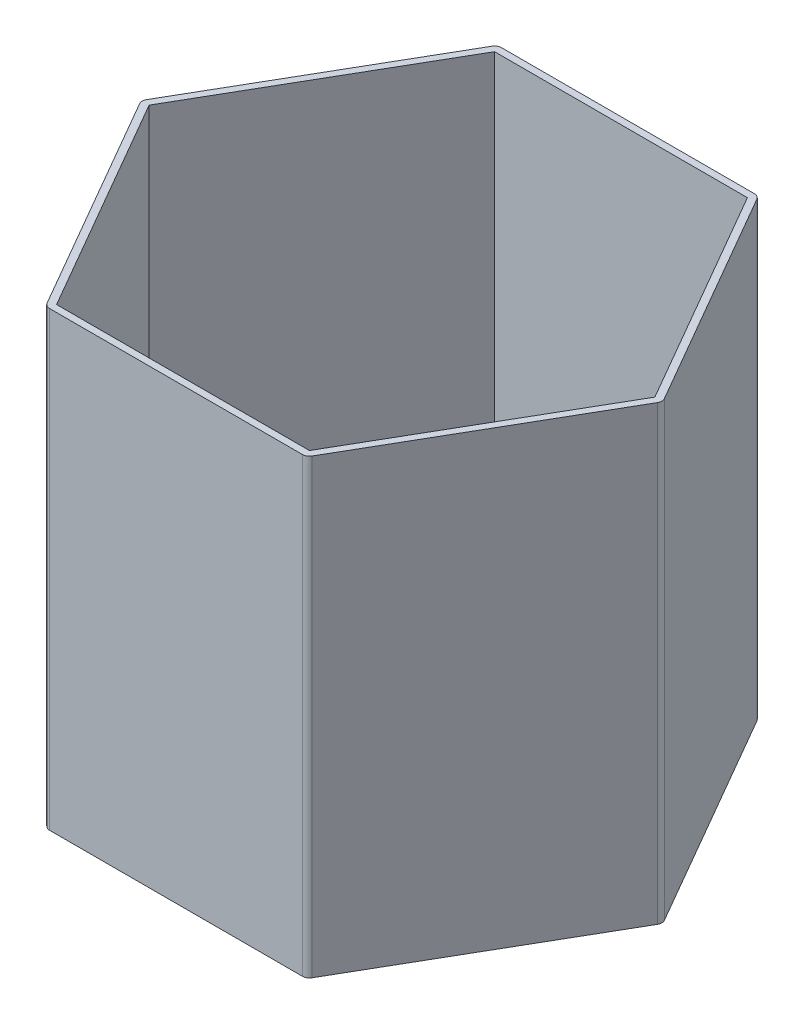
ISO-10303-21;
HEADER;
FILE_DESCRIPTION(('STEP AP214'),'2;1');
FILE_NAME('part.step','',(''),(''),'','','');
FILE_SCHEMA(('AUTOMOTIVE_DESIGN { 1 0 10303 214 1 1 1 1 }'));
ENDSEC;
DATA;
#1=APPLICATION_CONTEXT('core data for automotive mechanical design processes');
#2=APPLICATION_PROTOCOL_DEFINITION('international standard','automotive_design',2000,#1);
#3=PRODUCT_CONTEXT('',#1,'mechanical');
#4=PRODUCT('Part','Part','',(#3));
#5=PRODUCT_RELATED_PRODUCT_CATEGORY('part','',(#4));
#6=PRODUCT_DEFINITION_FORMATION('','',#4);
#7=PRODUCT_DEFINITION_CONTEXT('part definition',#1,'design');
#8=PRODUCT_DEFINITION('design','',#6,#7);
#9=PRODUCT_DEFINITION_SHAPE('','',#8);
#10=(LENGTH_UNIT() NAMED_UNIT(*) SI_UNIT(.MILLI.,.METRE.));
#11=(NAMED_UNIT(*) PLANE_ANGLE_UNIT() SI_UNIT($,.RADIAN.));
#12=(NAMED_UNIT(*) SI_UNIT($,.STERADIAN.) SOLID_ANGLE_UNIT());
#13=UNCERTAINTY_MEASURE_WITH_UNIT(LENGTH_MEASURE(1.E-05),#10,'distance_accuracy_value','');
#14=(GEOMETRIC_REPRESENTATION_CONTEXT(3) GLOBAL_UNCERTAINTY_ASSIGNED_CONTEXT((#13)) GLOBAL_UNIT_ASSIGNED_CONTEXT((#10,
#11,#12)) REPRESENTATION_CONTEXT('',''));
#15=CARTESIAN_POINT('',(0.,0.,0.));
#16=DIRECTION('',(0.,0.,1.));
#17=DIRECTION('',(1.,0.,0.));
#18=AXIS2_PLACEMENT_3D('',#15,#16,#17);
#19=CARTESIAN_POINT('',(-92.3875900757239,330.2,-160.02));
#20=DIRECTION('',(0.,-1.,0.));
#21=DIRECTION('',(0.,0.,-1.));
#22=AXIS2_PLACEMENT_3D('',#19,#20,#21);
#23=CYLINDRICAL_SURFACE('',#22,5.07999999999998);
#24=CARTESIAN_POINT('',(-92.3875900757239,0.,-160.02));
#25=DIRECTION('',(0.,1.,0.));
#26=DIRECTION('',(0.,0.,1.));
#27=AXIS2_PLACEMENT_3D('',#24,#25,#26);
#28=CIRCLE('',#27,5.07999999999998);
#29=CARTESIAN_POINT('',(-92.3875900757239,0.,-165.1));
#30=VERTEX_POINT('',#29);
#31=CARTESIAN_POINT('',(-96.7869991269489,0.,-162.56));
#32=VERTEX_POINT('',#31);
#33=EDGE_CURVE('E162',#30,#32,#28,.T.);
#34=ORIENTED_EDGE('',*,*,#33,.T.);
#35=DIRECTION('',(0.,-1.,0.));
#36=VECTOR('',#35,1.);
#37=CARTESIAN_POINT('',(-96.7869991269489,330.2,-162.56));
#38=LINE('',#37,#36);
#39=CARTESIAN_POINT('',(-96.7869991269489,330.2,-162.56));
#40=VERTEX_POINT('',#39);
#41=EDGE_CURVE('E11',#40,#32,#38,.T.);
#42=ORIENTED_EDGE('',*,*,#41,.F.);
#43=CARTESIAN_POINT('',(-92.3875900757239,330.2,-160.02));
#44=DIRECTION('',(0.,1.,0.));
#45=DIRECTION('',(0.,0.,1.));
#46=AXIS2_PLACEMENT_3D('',#43,#44,#45);
#47=CIRCLE('',#46,5.07999999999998);
#48=CARTESIAN_POINT('',(-92.3875900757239,330.2,-165.1));
#49=VERTEX_POINT('',#48);
#50=EDGE_CURVE('E186',#49,#40,#47,.T.);
#51=ORIENTED_EDGE('',*,*,#50,.F.);
#52=DIRECTION('',(0.,-1.,0.));
#53=VECTOR('',#52,1.);
#54=CARTESIAN_POINT('',(-92.3875900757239,330.2,-165.1));
#55=LINE('',#54,#53);
#56=EDGE_CURVE('E158',#49,#30,#55,.T.);
#57=ORIENTED_EDGE('',*,*,#56,.T.);
#58=EDGE_LOOP('',(#34,#42,#51,#57));
#59=FACE_BOUND('',#58,.T.);
#60=ADVANCED_FACE('F31',(#59),#23,.T.);
#61=CARTESIAN_POINT('',(-96.7869991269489,330.2,-162.56));
#62=DIRECTION('',(0.866025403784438,0.,0.5));
#63=DIRECTION('',(0.5,0.,-0.866025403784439));
#64=AXIS2_PLACEMENT_3D('',#61,#62,#63);
#65=PLANE('',#64);
#66=DIRECTION('',(-0.5,0.,0.866025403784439));
#67=VECTOR('',#66,1.);
#68=CARTESIAN_POINT('',(-96.7869991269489,0.,-162.56));
#69=LINE('',#68,#67);
#70=CARTESIAN_POINT('',(-189.174589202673,0.,-2.54000000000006));
#71=VERTEX_POINT('',#70);
#72=EDGE_CURVE('E165',#32,#71,#69,.T.);
#73=ORIENTED_EDGE('',*,*,#72,.T.);
#74=DIRECTION('',(0.,-1.,0.));
#75=VECTOR('',#74,1.);
#76=CARTESIAN_POINT('',(-189.174589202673,330.2,-2.54000000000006));
#77=LINE('',#76,#75);
#78=CARTESIAN_POINT('',(-189.174589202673,330.2,-2.54000000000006));
#79=VERTEX_POINT('',#78);
#80=EDGE_CURVE('E38',#79,#71,#77,.T.);
#81=ORIENTED_EDGE('',*,*,#80,.F.);
#82=DIRECTION('',(-0.5,0.,0.866025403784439));
#83=VECTOR('',#82,1.);
#84=CARTESIAN_POINT('',(-96.7869991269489,330.2,-162.56));
#85=LINE('',#84,#83);
#86=EDGE_CURVE('E107',#40,#79,#85,.T.);
#87=ORIENTED_EDGE('',*,*,#86,.F.);
#88=ORIENTED_EDGE('',*,*,#41,.T.);
#89=EDGE_LOOP('',(#73,#81,#87,#88));
#90=FACE_BOUND('',#89,.T.);
#91=ADVANCED_FACE('F363',(#90),#65,.F.);
#92=CARTESIAN_POINT('',(-184.775180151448,330.2,0.));
#93=DIRECTION('',(0.,-1.,0.));
#94=DIRECTION('',(0.,0.,-1.));
#95=AXIS2_PLACEMENT_3D('',#92,#93,#94);
#96=CYLINDRICAL_SURFACE('',#95,5.08000000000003);
#97=CARTESIAN_POINT('',(-184.775180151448,0.,0.));
#98=DIRECTION('',(0.,1.,0.));
#99=DIRECTION('',(0.,0.,1.));
#100=AXIS2_PLACEMENT_3D('',#97,#98,#99);
#101=CIRCLE('',#100,5.08000000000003);
#102=CARTESIAN_POINT('',(-189.174589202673,0.,2.53999999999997));
#103=VERTEX_POINT('',#102);
#104=EDGE_CURVE('E168',#71,#103,#101,.T.);
#105=ORIENTED_EDGE('',*,*,#104,.T.);
#106=DIRECTION('',(0.,-1.,0.));
#107=VECTOR('',#106,1.);
#108=CARTESIAN_POINT('',(-189.174589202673,330.2,2.53999999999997));
#109=LINE('',#108,#107);
#110=CARTESIAN_POINT('',(-189.174589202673,330.2,2.53999999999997));
#111=VERTEX_POINT('',#110);
#112=EDGE_CURVE('E205',#111,#103,#109,.T.);
#113=ORIENTED_EDGE('',*,*,#112,.F.);
#114=CARTESIAN_POINT('',(-184.775180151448,330.2,0.));
#115=DIRECTION('',(0.,1.,0.));
#116=DIRECTION('',(0.,0.,1.));
#117=AXIS2_PLACEMENT_3D('',#114,#115,#116);
#118=CIRCLE('',#117,5.08000000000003);
#119=EDGE_CURVE('E213',#79,#111,#118,.T.);
#120=ORIENTED_EDGE('',*,*,#119,.F.);
#121=ORIENTED_EDGE('',*,*,#80,.T.);
#122=EDGE_LOOP('',(#105,#113,#120,#121));
#123=FACE_BOUND('',#122,.T.);
#124=ADVANCED_FACE('F211',(#123),#96,.T.);
#125=CARTESIAN_POINT('',(-189.174589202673,330.2,2.53999999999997));
#126=DIRECTION('',(0.866025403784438,0.,-0.5));
#127=DIRECTION('',(-0.5,0.,-0.866025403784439));
#128=AXIS2_PLACEMENT_3D('',#125,#126,#127);
#129=PLANE('',#128);
#130=DIRECTION('',(0.5,0.,0.866025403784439));
#131=VECTOR('',#130,1.);
#132=CARTESIAN_POINT('',(-189.174589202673,0.,2.53999999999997));
#133=LINE('',#132,#131);
#134=CARTESIAN_POINT('',(-96.7869991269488,0.,162.56));
#135=VERTEX_POINT('',#134);
#136=EDGE_CURVE('E170',#103,#135,#133,.T.);
#137=ORIENTED_EDGE('',*,*,#136,.T.);
#138=DIRECTION('',(0.,-1.,0.));
#139=VECTOR('',#138,1.);
#140=CARTESIAN_POINT('',(-96.7869991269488,330.2,162.56));
#141=LINE('',#140,#139);
#142=CARTESIAN_POINT('',(-96.7869991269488,330.2,162.56));
#143=VERTEX_POINT('',#142);
#144=EDGE_CURVE('E202',#143,#135,#141,.T.);
#145=ORIENTED_EDGE('',*,*,#144,.F.);
#146=DIRECTION('',(0.5,0.,0.866025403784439));
#147=VECTOR('',#146,1.);
#148=CARTESIAN_POINT('',(-189.174589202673,330.2,2.53999999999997));
#149=LINE('',#148,#147);
#150=EDGE_CURVE('E231',#111,#143,#149,.T.);
#151=ORIENTED_EDGE('',*,*,#150,.F.);
#152=ORIENTED_EDGE('',*,*,#112,.T.);
#153=EDGE_LOOP('',(#137,#145,#151,#152));
#154=FACE_BOUND('',#153,.T.);
#155=ADVANCED_FACE('F222',(#154),#129,.F.);
#156=CARTESIAN_POINT('',(-92.3875900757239,330.2,160.02));
#157=DIRECTION('',(0.,-1.,0.));
#158=DIRECTION('',(0.,0.,-1.));
#159=AXIS2_PLACEMENT_3D('',#156,#157,#158);
#160=CYLINDRICAL_SURFACE('',#159,5.08000000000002);
#161=CARTESIAN_POINT('',(-92.3875900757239,0.,160.02));
#162=DIRECTION('',(0.,1.,0.));
#163=DIRECTION('',(0.,0.,1.));
#164=AXIS2_PLACEMENT_3D('',#161,#162,#163);
#165=CIRCLE('',#164,5.08000000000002);
#166=CARTESIAN_POINT('',(-92.3875900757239,0.,165.1));
#167=VERTEX_POINT('',#166);
#168=EDGE_CURVE('E172',#135,#167,#165,.T.);
#169=ORIENTED_EDGE('',*,*,#168,.T.);
#170=DIRECTION('',(0.,-1.,0.));
#171=VECTOR('',#170,1.);
#172=CARTESIAN_POINT('',(-92.3875900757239,330.2,165.1));
#173=LINE('',#172,#171);
#174=CARTESIAN_POINT('',(-92.3875900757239,330.2,165.1));
#175=VERTEX_POINT('',#174);
#176=EDGE_CURVE('E199',#175,#167,#173,.T.);
#177=ORIENTED_EDGE('',*,*,#176,.F.);
#178=CARTESIAN_POINT('',(-92.3875900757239,330.2,160.02));
#179=DIRECTION('',(0.,1.,0.));
#180=DIRECTION('',(0.,0.,1.));
#181=AXIS2_PLACEMENT_3D('',#178,#179,#180);
#182=CIRCLE('',#181,5.08000000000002);
#183=EDGE_CURVE('E228',#143,#175,#182,.T.);
#184=ORIENTED_EDGE('',*,*,#183,.F.);
#185=ORIENTED_EDGE('',*,*,#144,.T.);
#186=EDGE_LOOP('',(#169,#177,#184,#185));
#187=FACE_BOUND('',#186,.T.);
#188=ADVANCED_FACE('F226',(#187),#160,.T.);
#189=CARTESIAN_POINT('',(-92.3875900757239,330.2,165.1));
#190=DIRECTION('',(0.,0.,-1.));
#191=DIRECTION('',(-1.,0.,0.));
#192=AXIS2_PLACEMENT_3D('',#189,#190,#191);
#193=PLANE('',#192);
#194=DIRECTION('',(1.,0.,0.));
#195=VECTOR('',#194,1.);
#196=CARTESIAN_POINT('',(-92.3875900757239,0.,165.1));
#197=LINE('',#196,#195);
#198=CARTESIAN_POINT('',(92.3875900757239,0.,165.1));
#199=VERTEX_POINT('',#198);
#200=EDGE_CURVE('E174',#167,#199,#197,.T.);
#201=ORIENTED_EDGE('',*,*,#200,.T.);
#202=DIRECTION('',(0.,-1.,0.));
#203=VECTOR('',#202,1.);
#204=CARTESIAN_POINT('',(92.3875900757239,330.2,165.1));
#205=LINE('',#204,#203);
#206=CARTESIAN_POINT('',(92.3875900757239,330.2,165.1));
#207=VERTEX_POINT('',#206);
#208=EDGE_CURVE('E196',#207,#199,#205,.T.);
#209=ORIENTED_EDGE('',*,*,#208,.F.);
#210=DIRECTION('',(1.,0.,0.));
#211=VECTOR('',#210,1.);
#212=CARTESIAN_POINT('',(-92.3875900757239,330.2,165.1));
#213=LINE('',#212,#211);
#214=EDGE_CURVE('E230',#175,#207,#213,.T.);
#215=ORIENTED_EDGE('',*,*,#214,.F.);
#216=ORIENTED_EDGE('',*,*,#176,.T.);
#217=EDGE_LOOP('',(#201,#209,#215,#216));
#218=FACE_BOUND('',#217,.T.);
#219=ADVANCED_FACE('F376',(#218),#193,.F.);
#220=CARTESIAN_POINT('',(92.3875900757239,330.2,160.02));
#221=DIRECTION('',(0.,-1.,0.));
#222=DIRECTION('',(0.,0.,-1.));
#223=AXIS2_PLACEMENT_3D('',#220,#221,#222);
#224=CYLINDRICAL_SURFACE('',#223,5.08);
#225=CARTESIAN_POINT('',(92.3875900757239,0.,160.02));
#226=DIRECTION('',(0.,1.,0.));
#227=DIRECTION('',(0.,0.,1.));
#228=AXIS2_PLACEMENT_3D('',#225,#226,#227);
#229=CIRCLE('',#228,5.08);
#230=CARTESIAN_POINT('',(96.7869991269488,0.,162.56));
#231=VERTEX_POINT('',#230);
#232=EDGE_CURVE('E176',#199,#231,#229,.T.);
#233=ORIENTED_EDGE('',*,*,#232,.T.);
#234=DIRECTION('',(0.,-1.,0.));
#235=VECTOR('',#234,1.);
#236=CARTESIAN_POINT('',(96.7869991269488,330.2,162.56));
#237=LINE('',#236,#235);
#238=CARTESIAN_POINT('',(96.7869991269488,330.2,162.56));
#239=VERTEX_POINT('',#238);
#240=EDGE_CURVE('E193',#239,#231,#237,.T.);
#241=ORIENTED_EDGE('',*,*,#240,.F.);
#242=CARTESIAN_POINT('',(92.3875900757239,330.2,160.02));
#243=DIRECTION('',(0.,1.,0.));
#244=DIRECTION('',(0.,0.,1.));
#245=AXIS2_PLACEMENT_3D('',#242,#243,#244);
#246=CIRCLE('',#245,5.08);
#247=EDGE_CURVE('E233',#207,#239,#246,.T.);
#248=ORIENTED_EDGE('',*,*,#247,.F.);
#249=ORIENTED_EDGE('',*,*,#208,.T.);
#250=EDGE_LOOP('',(#233,#241,#248,#249));
#251=FACE_BOUND('',#250,.T.);
#252=ADVANCED_FACE('F379',(#251),#224,.T.);
#253=CARTESIAN_POINT('',(96.7869991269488,330.2,162.56));
#254=DIRECTION('',(-0.866025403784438,0.,-0.5));
#255=DIRECTION('',(-0.5,0.,0.866025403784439));
#256=AXIS2_PLACEMENT_3D('',#253,#254,#255);
#257=PLANE('',#256);
#258=DIRECTION('',(0.5,0.,-0.866025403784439));
#259=VECTOR('',#258,1.);
#260=CARTESIAN_POINT('',(96.7869991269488,0.,162.56));
#261=LINE('',#260,#259);
#262=CARTESIAN_POINT('',(189.174589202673,0.,2.53999999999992));
#263=VERTEX_POINT('',#262);
#264=EDGE_CURVE('E178',#231,#263,#261,.T.);
#265=ORIENTED_EDGE('',*,*,#264,.T.);
#266=DIRECTION('',(0.,-1.,0.));
#267=VECTOR('',#266,1.);
#268=CARTESIAN_POINT('',(189.174589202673,330.2,2.53999999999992));
#269=LINE('',#268,#267);
#270=CARTESIAN_POINT('',(189.174589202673,330.2,2.53999999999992));
#271=VERTEX_POINT('',#270);
#272=EDGE_CURVE('E190',#271,#263,#269,.T.);
#273=ORIENTED_EDGE('',*,*,#272,.F.);
#274=DIRECTION('',(0.5,0.,-0.866025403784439));
#275=VECTOR('',#274,1.);
#276=CARTESIAN_POINT('',(96.7869991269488,330.2,162.56));
#277=LINE('',#276,#275);
#278=EDGE_CURVE('E239',#239,#271,#277,.T.);
#279=ORIENTED_EDGE('',*,*,#278,.F.);
#280=ORIENTED_EDGE('',*,*,#240,.T.);
#281=EDGE_LOOP('',(#265,#273,#279,#280));
#282=FACE_BOUND('',#281,.T.);
#283=ADVANCED_FACE('F245',(#282),#257,.F.);
#284=CARTESIAN_POINT('',(184.775180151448,330.2,0.));
#285=DIRECTION('',(0.,-1.,0.));
#286=DIRECTION('',(0.,0.,-1.));
#287=AXIS2_PLACEMENT_3D('',#284,#285,#286);
#288=CYLINDRICAL_SURFACE('',#287,5.08);
#289=CARTESIAN_POINT('',(184.775180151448,0.,0.));
#290=DIRECTION('',(0.,1.,0.));
#291=DIRECTION('',(0.,0.,1.));
#292=AXIS2_PLACEMENT_3D('',#289,#290,#291);
#293=CIRCLE('',#292,5.08);
#294=CARTESIAN_POINT('',(189.174589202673,0.,-2.54000000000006));
#295=VERTEX_POINT('',#294);
#296=EDGE_CURVE('E180',#263,#295,#293,.T.);
#297=ORIENTED_EDGE('',*,*,#296,.T.);
#298=DIRECTION('',(0.,-1.,0.));
#299=VECTOR('',#298,1.);
#300=CARTESIAN_POINT('',(189.174589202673,330.2,-2.54000000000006));
#301=LINE('',#300,#299);
#302=CARTESIAN_POINT('',(189.174589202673,330.2,-2.54000000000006));
#303=VERTEX_POINT('',#302);
#304=EDGE_CURVE('E153',#303,#295,#301,.T.);
#305=ORIENTED_EDGE('',*,*,#304,.F.);
#306=CARTESIAN_POINT('',(184.775180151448,330.2,0.));
#307=DIRECTION('',(0.,1.,0.));
#308=DIRECTION('',(0.,0.,1.));
#309=AXIS2_PLACEMENT_3D('',#306,#307,#308);
#310=CIRCLE('',#309,5.08);
#311=EDGE_CURVE('E141',#271,#303,#310,.T.);
#312=ORIENTED_EDGE('',*,*,#311,.F.);
#313=ORIENTED_EDGE('',*,*,#272,.T.);
#314=EDGE_LOOP('',(#297,#305,#312,#313));
#315=FACE_BOUND('',#314,.T.);
#316=ADVANCED_FACE('F249',(#315),#288,.T.);
#317=CARTESIAN_POINT('',(189.174589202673,330.2,-2.54000000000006));
#318=DIRECTION('',(-0.866025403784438,0.,0.5));
#319=DIRECTION('',(0.5,0.,0.866025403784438));
#320=AXIS2_PLACEMENT_3D('',#317,#318,#319);
#321=PLANE('',#320);
#322=DIRECTION('',(-0.5,0.,-0.866025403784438));
#323=VECTOR('',#322,1.);
#324=CARTESIAN_POINT('',(189.174589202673,0.,-2.54000000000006));
#325=LINE('',#324,#323);
#326=CARTESIAN_POINT('',(96.7869991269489,0.,-162.56));
#327=VERTEX_POINT('',#326);
#328=EDGE_CURVE('E150',#295,#327,#325,.T.);
#329=ORIENTED_EDGE('',*,*,#328,.T.);
#330=DIRECTION('',(0.,-1.,0.));
#331=VECTOR('',#330,1.);
#332=CARTESIAN_POINT('',(96.7869991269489,330.2,-162.56));
#333=LINE('',#332,#331);
#334=CARTESIAN_POINT('',(96.7869991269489,330.2,-162.56));
#335=VERTEX_POINT('',#334);
#336=EDGE_CURVE('E147',#335,#327,#333,.T.);
#337=ORIENTED_EDGE('',*,*,#336,.F.);
#338=DIRECTION('',(-0.5,0.,-0.866025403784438));
#339=VECTOR('',#338,1.);
#340=CARTESIAN_POINT('',(189.174589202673,330.2,-2.54000000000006));
#341=LINE('',#340,#339);
#342=EDGE_CURVE('E134',#303,#335,#341,.T.);
#343=ORIENTED_EDGE('',*,*,#342,.F.);
#344=ORIENTED_EDGE('',*,*,#304,.T.);
#345=EDGE_LOOP('',(#329,#337,#343,#344));
#346=FACE_BOUND('',#345,.T.);
#347=ADVANCED_FACE('F148',(#346),#321,.F.);
#348=CARTESIAN_POINT('',(92.3875900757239,330.2,-160.02));
#349=DIRECTION('',(0.,-1.,0.));
#350=DIRECTION('',(0.,0.,-1.));
#351=AXIS2_PLACEMENT_3D('',#348,#349,#350);
#352=CYLINDRICAL_SURFACE('',#351,5.07999999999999);
#353=CARTESIAN_POINT('',(92.3875900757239,0.,-160.02));
#354=DIRECTION('',(0.,1.,0.));
#355=DIRECTION('',(0.,0.,-1.));
#356=AXIS2_PLACEMENT_3D('',#353,#354,#355);
#357=CIRCLE('',#356,5.07999999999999);
#358=CARTESIAN_POINT('',(92.3875900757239,0.,-165.1));
#359=VERTEX_POINT('',#358);
#360=EDGE_CURVE('E183',#327,#359,#357,.T.);
#361=ORIENTED_EDGE('',*,*,#360,.T.);
#362=DIRECTION('',(0.,-1.,0.));
#363=VECTOR('',#362,1.);
#364=CARTESIAN_POINT('',(92.3875900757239,330.2,-165.1));
#365=LINE('',#364,#363);
#366=CARTESIAN_POINT('',(92.3875900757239,330.2,-165.1));
#367=VERTEX_POINT('',#366);
#368=EDGE_CURVE('E154',#367,#359,#365,.T.);
#369=ORIENTED_EDGE('',*,*,#368,.F.);
#370=CARTESIAN_POINT('',(92.3875900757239,330.2,-160.02));
#371=DIRECTION('',(0.,1.,0.));
#372=DIRECTION('',(0.,0.,-1.));
#373=AXIS2_PLACEMENT_3D('',#370,#371,#372);
#374=CIRCLE('',#373,5.07999999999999);
#375=EDGE_CURVE('E138',#335,#367,#374,.T.);
#376=ORIENTED_EDGE('',*,*,#375,.F.);
#377=ORIENTED_EDGE('',*,*,#336,.T.);
#378=EDGE_LOOP('',(#361,#369,#376,#377));
#379=FACE_BOUND('',#378,.T.);
#380=ADVANCED_FACE('F156',(#379),#352,.T.);
#381=CARTESIAN_POINT('',(92.3875900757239,330.2,-165.1));
#382=DIRECTION('',(0.,0.,1.));
#383=DIRECTION('',(1.,0.,0.));
#384=AXIS2_PLACEMENT_3D('',#381,#382,#383);
#385=PLANE('',#384);
#386=DIRECTION('',(-1.,0.,0.));
#387=VECTOR('',#386,1.);
#388=CARTESIAN_POINT('',(92.3875900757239,0.,-165.1));
#389=LINE('',#388,#387);
#390=EDGE_CURVE('E99',#359,#30,#389,.T.);
#391=ORIENTED_EDGE('',*,*,#390,.T.);
#392=ORIENTED_EDGE('',*,*,#56,.F.);
#393=DIRECTION('',(-1.,0.,0.));
#394=VECTOR('',#393,1.);
#395=CARTESIAN_POINT('',(92.3875900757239,330.2,-165.1));
#396=LINE('',#395,#394);
#397=EDGE_CURVE('E54',#367,#49,#396,.T.);
#398=ORIENTED_EDGE('',*,*,#397,.F.);
#399=ORIENTED_EDGE('',*,*,#368,.T.);
#400=EDGE_LOOP('',(#391,#392,#398,#399));
#401=FACE_BOUND('',#400,.T.);
#402=ADVANCED_FACE('F250',(#401),#385,.F.);
#403=CARTESIAN_POINT('',(-92.3875900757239,330.2,-160.02));
#404=DIRECTION('',(0.,1.,0.));
#405=DIRECTION('',(0.,0.,1.));
#406=AXIS2_PLACEMENT_3D('',#403,#404,#405);
#407=PLANE('',#406);
#408=DIRECTION('',(-1.,0.,0.));
#409=VECTOR('',#408,1.);
#410=CARTESIAN_POINT('',(92.3875900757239,330.2,-160.02));
#411=LINE('',#410,#409);
#412=CARTESIAN_POINT('',(92.3875900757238,330.2,-160.02));
#413=VERTEX_POINT('',#412);
#414=CARTESIAN_POINT('',(-92.3875900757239,330.2,-160.02));
#415=VERTEX_POINT('',#414);
#416=EDGE_CURVE('E257',#413,#415,#411,.T.);
#417=ORIENTED_EDGE('',*,*,#416,.F.);
#418=DIRECTION('',(-0.5,0.,-0.866025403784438));
#419=VECTOR('',#418,1.);
#420=CARTESIAN_POINT('',(184.775180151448,330.2,0.));
#421=LINE('',#420,#419);
#422=CARTESIAN_POINT('',(184.775180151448,330.2,0.));
#423=VERTEX_POINT('',#422);
#424=EDGE_CURVE('E261',#423,#413,#421,.T.);
#425=ORIENTED_EDGE('',*,*,#424,.F.);
#426=DIRECTION('',(0.5,0.,-0.866025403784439));
#427=VECTOR('',#426,1.);
#428=CARTESIAN_POINT('',(92.3875900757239,330.2,160.02));
#429=LINE('',#428,#427);
#430=CARTESIAN_POINT('',(92.3875900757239,330.2,160.02));
#431=VERTEX_POINT('',#430);
#432=EDGE_CURVE('E263',#431,#423,#429,.T.);
#433=ORIENTED_EDGE('',*,*,#432,.F.);
#434=DIRECTION('',(1.,0.,0.));
#435=VECTOR('',#434,1.);
#436=CARTESIAN_POINT('',(-92.3875900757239,330.2,160.02));
#437=LINE('',#436,#435);
#438=CARTESIAN_POINT('',(-92.3875900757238,330.2,160.02));
#439=VERTEX_POINT('',#438);
#440=EDGE_CURVE('E265',#439,#431,#437,.T.);
#441=ORIENTED_EDGE('',*,*,#440,.F.);
#442=DIRECTION('',(0.5,0.,0.866025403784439));
#443=VECTOR('',#442,1.);
#444=CARTESIAN_POINT('',(-184.775180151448,330.2,0.));
#445=LINE('',#444,#443);
#446=CARTESIAN_POINT('',(-184.775180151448,330.2,0.));
#447=VERTEX_POINT('',#446);
#448=EDGE_CURVE('E268',#447,#439,#445,.T.);
#449=ORIENTED_EDGE('',*,*,#448,.F.);
#450=DIRECTION('',(-0.5,0.,0.866025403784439));
#451=VECTOR('',#450,1.);
#452=CARTESIAN_POINT('',(-92.3875900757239,330.2,-160.02));
#453=LINE('',#452,#451);
#454=EDGE_CURVE('E271',#415,#447,#453,.T.);
#455=ORIENTED_EDGE('',*,*,#454,.F.);
#456=EDGE_LOOP('',(#417,#425,#433,#441,#449,#455));
#457=FACE_BOUND('',#456,.T.);
#458=ORIENTED_EDGE('',*,*,#50,.T.);
#459=ORIENTED_EDGE('',*,*,#86,.T.);
#460=ORIENTED_EDGE('',*,*,#119,.T.);
#461=ORIENTED_EDGE('',*,*,#150,.T.);
#462=ORIENTED_EDGE('',*,*,#183,.T.);
#463=ORIENTED_EDGE('',*,*,#214,.T.);
#464=ORIENTED_EDGE('',*,*,#247,.T.);
#465=ORIENTED_EDGE('',*,*,#278,.T.);
#466=ORIENTED_EDGE('',*,*,#311,.T.);
#467=ORIENTED_EDGE('',*,*,#342,.T.);
#468=ORIENTED_EDGE('',*,*,#375,.T.);
#469=ORIENTED_EDGE('',*,*,#397,.T.);
#470=EDGE_LOOP('',(#458,#459,#460,#461,#462,#463,#464,#465,#466,#467,#468,#469));
#471=FACE_BOUND('',#470,.T.);
#472=ADVANCED_FACE('F136',(#457,#471),#407,.T.);
#473=CARTESIAN_POINT('',(-92.3875900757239,0.,-160.02));
#474=DIRECTION('',(0.,1.,0.));
#475=DIRECTION('',(0.,0.,1.));
#476=AXIS2_PLACEMENT_3D('',#473,#474,#475);
#477=PLANE('',#476);
#478=ORIENTED_EDGE('',*,*,#33,.F.);
#479=ORIENTED_EDGE('',*,*,#390,.F.);
#480=ORIENTED_EDGE('',*,*,#360,.F.);
#481=ORIENTED_EDGE('',*,*,#328,.F.);
#482=ORIENTED_EDGE('',*,*,#296,.F.);
#483=ORIENTED_EDGE('',*,*,#264,.F.);
#484=ORIENTED_EDGE('',*,*,#232,.F.);
#485=ORIENTED_EDGE('',*,*,#200,.F.);
#486=ORIENTED_EDGE('',*,*,#168,.F.);
#487=ORIENTED_EDGE('',*,*,#136,.F.);
#488=ORIENTED_EDGE('',*,*,#104,.F.);
#489=ORIENTED_EDGE('',*,*,#72,.F.);
#490=EDGE_LOOP('',(#478,#479,#480,#481,#482,#483,#484,#485,#486,#487,#488,#489));
#491=FACE_BOUND('',#490,.T.);
#492=ADVANCED_FACE('F217',(#491),#477,.F.);
#493=CARTESIAN_POINT('',(-92.3875900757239,330.2,-160.02));
#494=DIRECTION('',(0.866025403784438,0.,0.5));
#495=DIRECTION('',(0.5,0.,-0.866025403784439));
#496=AXIS2_PLACEMENT_3D('',#493,#494,#495);
#497=PLANE('',#496);
#498=DIRECTION('',(-0.5,0.,0.866025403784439));
#499=VECTOR('',#498,1.);
#500=CARTESIAN_POINT('',(-92.3875900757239,7.62000000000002,-160.02));
#501=LINE('',#500,#499);
#502=CARTESIAN_POINT('',(-92.3875900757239,7.62,-160.02));
#503=VERTEX_POINT('',#502);
#504=CARTESIAN_POINT('',(-184.775180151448,7.62,0.));
#505=VERTEX_POINT('',#504);
#506=EDGE_CURVE('E299',#503,#505,#501,.T.);
#507=ORIENTED_EDGE('',*,*,#506,.F.);
#508=DIRECTION('',(0.,-1.,0.));
#509=VECTOR('',#508,1.);
#510=CARTESIAN_POINT('',(-92.3875900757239,330.2,-160.02));
#511=LINE('',#510,#509);
#512=EDGE_CURVE('E166',#415,#503,#511,.T.);
#513=ORIENTED_EDGE('',*,*,#512,.F.);
#514=ORIENTED_EDGE('',*,*,#454,.T.);
#515=DIRECTION('',(0.,-1.,0.));
#516=VECTOR('',#515,1.);
#517=CARTESIAN_POINT('',(-184.775180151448,330.2,0.));
#518=LINE('',#517,#516);
#519=EDGE_CURVE('E296',#447,#505,#518,.T.);
#520=ORIENTED_EDGE('',*,*,#519,.T.);
#521=EDGE_LOOP('',(#507,#513,#514,#520));
#522=FACE_BOUND('',#521,.T.);
#523=ADVANCED_FACE('F316',(#522),#497,.T.);
#524=CARTESIAN_POINT('',(-184.775180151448,330.2,0.));
#525=DIRECTION('',(0.866025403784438,0.,-0.5));
#526=DIRECTION('',(-0.5,0.,-0.866025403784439));
#527=AXIS2_PLACEMENT_3D('',#524,#525,#526);
#528=PLANE('',#527);
#529=DIRECTION('',(0.5,0.,0.866025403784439));
#530=VECTOR('',#529,1.);
#531=CARTESIAN_POINT('',(-184.775180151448,7.62000000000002,0.));
#532=LINE('',#531,#530);
#533=CARTESIAN_POINT('',(-92.3875900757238,7.62,160.02));
#534=VERTEX_POINT('',#533);
#535=EDGE_CURVE('E293',#505,#534,#532,.T.);
#536=ORIENTED_EDGE('',*,*,#535,.F.);
#537=ORIENTED_EDGE('',*,*,#519,.F.);
#538=ORIENTED_EDGE('',*,*,#448,.T.);
#539=DIRECTION('',(0.,-1.,0.));
#540=VECTOR('',#539,1.);
#541=CARTESIAN_POINT('',(-92.3875900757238,330.2,160.02));
#542=LINE('',#541,#540);
#543=EDGE_CURVE('E290',#439,#534,#542,.T.);
#544=ORIENTED_EDGE('',*,*,#543,.T.);
#545=EDGE_LOOP('',(#536,#537,#538,#544));
#546=FACE_BOUND('',#545,.T.);
#547=ADVANCED_FACE('F346',(#546),#528,.T.);
#548=CARTESIAN_POINT('',(-92.3875900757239,330.2,160.02));
#549=DIRECTION('',(0.,0.,-1.));
#550=DIRECTION('',(-1.,0.,0.));
#551=AXIS2_PLACEMENT_3D('',#548,#549,#550);
#552=PLANE('',#551);
#553=DIRECTION('',(1.,0.,0.));
#554=VECTOR('',#553,1.);
#555=CARTESIAN_POINT('',(-92.3875900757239,7.62000000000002,160.02));
#556=LINE('',#555,#554);
#557=CARTESIAN_POINT('',(92.3875900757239,7.62,160.02));
#558=VERTEX_POINT('',#557);
#559=EDGE_CURVE('E287',#534,#558,#556,.T.);
#560=ORIENTED_EDGE('',*,*,#559,.F.);
#561=ORIENTED_EDGE('',*,*,#543,.F.);
#562=ORIENTED_EDGE('',*,*,#440,.T.);
#563=DIRECTION('',(0.,-1.,0.));
#564=VECTOR('',#563,1.);
#565=CARTESIAN_POINT('',(92.3875900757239,330.2,160.02));
#566=LINE('',#565,#564);
#567=EDGE_CURVE('E284',#431,#558,#566,.T.);
#568=ORIENTED_EDGE('',*,*,#567,.T.);
#569=EDGE_LOOP('',(#560,#561,#562,#568));
#570=FACE_BOUND('',#569,.T.);
#571=ADVANCED_FACE('F349',(#570),#552,.T.);
#572=CARTESIAN_POINT('',(92.3875900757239,330.2,160.02));
#573=DIRECTION('',(-0.866025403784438,0.,-0.5));
#574=DIRECTION('',(-0.5,0.,0.866025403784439));
#575=AXIS2_PLACEMENT_3D('',#572,#573,#574);
#576=PLANE('',#575);
#577=DIRECTION('',(0.5,0.,-0.866025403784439));
#578=VECTOR('',#577,1.);
#579=CARTESIAN_POINT('',(92.3875900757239,7.62000000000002,160.02));
#580=LINE('',#579,#578);
#581=CARTESIAN_POINT('',(184.775180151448,7.62,0.));
#582=VERTEX_POINT('',#581);
#583=EDGE_CURVE('E282',#558,#582,#580,.T.);
#584=ORIENTED_EDGE('',*,*,#583,.F.);
#585=ORIENTED_EDGE('',*,*,#567,.F.);
#586=ORIENTED_EDGE('',*,*,#432,.T.);
#587=DIRECTION('',(0.,-1.,0.));
#588=VECTOR('',#587,1.);
#589=CARTESIAN_POINT('',(184.775180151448,330.2,0.));
#590=LINE('',#589,#588);
#591=EDGE_CURVE('E45',#423,#582,#590,.T.);
#592=ORIENTED_EDGE('',*,*,#591,.T.);
#593=EDGE_LOOP('',(#584,#585,#586,#592));
#594=FACE_BOUND('',#593,.T.);
#595=ADVANCED_FACE('F352',(#594),#576,.T.);
#596=CARTESIAN_POINT('',(184.775180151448,330.2,0.));
#597=DIRECTION('',(-0.866025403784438,0.,0.5));
#598=DIRECTION('',(0.5,0.,0.866025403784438));
#599=AXIS2_PLACEMENT_3D('',#596,#597,#598);
#600=PLANE('',#599);
#601=DIRECTION('',(-0.5,0.,-0.866025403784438));
#602=VECTOR('',#601,1.);
#603=CARTESIAN_POINT('',(184.775180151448,7.62000000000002,0.));
#604=LINE('',#603,#602);
#605=CARTESIAN_POINT('',(92.3875900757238,7.62,-160.02));
#606=VERTEX_POINT('',#605);
#607=EDGE_CURVE('E277',#582,#606,#604,.T.);
#608=ORIENTED_EDGE('',*,*,#607,.F.);
#609=ORIENTED_EDGE('',*,*,#591,.F.);
#610=ORIENTED_EDGE('',*,*,#424,.T.);
#611=DIRECTION('',(0.,-1.,0.));
#612=VECTOR('',#611,1.);
#613=CARTESIAN_POINT('',(92.3875900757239,330.2,-160.02));
#614=LINE('',#613,#612);
#615=EDGE_CURVE('E260',#413,#606,#614,.T.);
#616=ORIENTED_EDGE('',*,*,#615,.T.);
#617=EDGE_LOOP('',(#608,#609,#610,#616));
#618=FACE_BOUND('',#617,.T.);
#619=ADVANCED_FACE('F353',(#618),#600,.T.);
#620=CARTESIAN_POINT('',(92.3875900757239,330.2,-160.02));
#621=DIRECTION('',(0.,0.,1.));
#622=DIRECTION('',(1.,0.,0.));
#623=AXIS2_PLACEMENT_3D('',#620,#621,#622);
#624=PLANE('',#623);
#625=DIRECTION('',(-1.,0.,0.));
#626=VECTOR('',#625,1.);
#627=CARTESIAN_POINT('',(92.3875900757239,7.62000000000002,-160.02));
#628=LINE('',#627,#626);
#629=EDGE_CURVE('E274',#606,#503,#628,.T.);
#630=ORIENTED_EDGE('',*,*,#629,.F.);
#631=ORIENTED_EDGE('',*,*,#615,.F.);
#632=ORIENTED_EDGE('',*,*,#416,.T.);
#633=ORIENTED_EDGE('',*,*,#512,.T.);
#634=EDGE_LOOP('',(#630,#631,#632,#633));
#635=FACE_BOUND('',#634,.T.);
#636=ADVANCED_FACE('F340',(#635),#624,.T.);
#637=CARTESIAN_POINT('',(-92.3875900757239,7.62,-160.02));
#638=DIRECTION('',(0.,1.,0.));
#639=DIRECTION('',(0.,0.,1.));
#640=AXIS2_PLACEMENT_3D('',#637,#638,#639);
#641=PLANE('',#640);
#642=ORIENTED_EDGE('',*,*,#506,.T.);
#643=ORIENTED_EDGE('',*,*,#535,.T.);
#644=ORIENTED_EDGE('',*,*,#559,.T.);
#645=ORIENTED_EDGE('',*,*,#583,.T.);
#646=ORIENTED_EDGE('',*,*,#607,.T.);
#647=ORIENTED_EDGE('',*,*,#629,.T.);
#648=EDGE_LOOP('',(#642,#643,#644,#645,#646,#647));
#649=FACE_BOUND('',#648,.T.);
#650=ADVANCED_FACE('F308',(#649),#641,.T.);
#651=CLOSED_SHELL('',(#60,#91,#124,#155,#188,#219,#252,#283,#316,#347,#380,#402,#472,#492,#523,
#547,#571,#595,#619,#636,#650));
#652=MANIFOLD_SOLID_BREP('B2',#651);
#653=ADVANCED_BREP_SHAPE_REPRESENTATION('',(#18,#652),#14);
#654=SHAPE_DEFINITION_REPRESENTATION(#9,#653);
ENDSEC;
END-ISO-10303-21;
